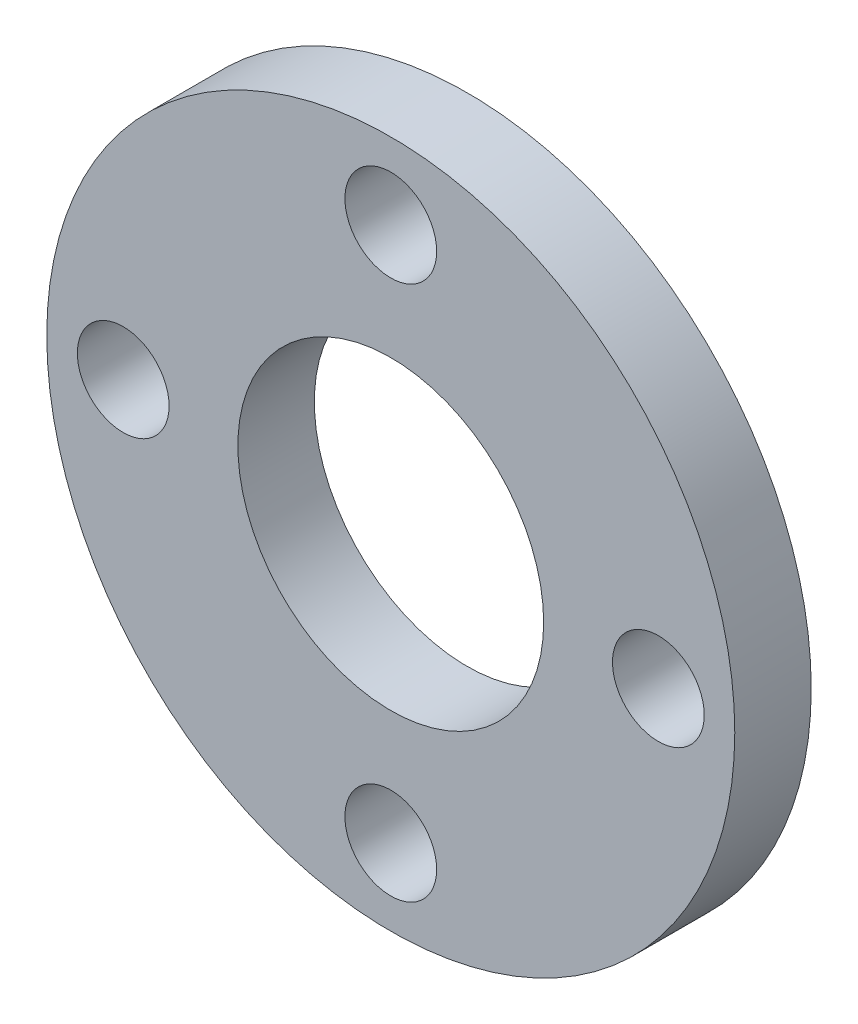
ISO-10303-21;
HEADER;
FILE_DESCRIPTION(('STEP AP214'),'2;1');
FILE_NAME('part.step','',(''),(''),'','','');
FILE_SCHEMA(('AUTOMOTIVE_DESIGN { 1 0 10303 214 1 1 1 1 }'));
ENDSEC;
DATA;
#1=APPLICATION_CONTEXT('core data for automotive mechanical design processes');
#2=APPLICATION_PROTOCOL_DEFINITION('international standard','automotive_design',2000,#1);
#3=PRODUCT_CONTEXT('',#1,'mechanical');
#4=PRODUCT('Part','Part','',(#3));
#5=PRODUCT_RELATED_PRODUCT_CATEGORY('part','',(#4));
#6=PRODUCT_DEFINITION_FORMATION('','',#4);
#7=PRODUCT_DEFINITION_CONTEXT('part definition',#1,'design');
#8=PRODUCT_DEFINITION('design','',#6,#7);
#9=PRODUCT_DEFINITION_SHAPE('','',#8);
#10=(LENGTH_UNIT() NAMED_UNIT(*) SI_UNIT(.MILLI.,.METRE.));
#11=(NAMED_UNIT(*) PLANE_ANGLE_UNIT() SI_UNIT($,.RADIAN.));
#12=(NAMED_UNIT(*) SI_UNIT($,.STERADIAN.) SOLID_ANGLE_UNIT());
#13=UNCERTAINTY_MEASURE_WITH_UNIT(LENGTH_MEASURE(1.E-05),#10,'distance_accuracy_value','');
#14=(GEOMETRIC_REPRESENTATION_CONTEXT(3) GLOBAL_UNCERTAINTY_ASSIGNED_CONTEXT((#13)) GLOBAL_UNIT_ASSIGNED_CONTEXT((#10,
#11,#12)) REPRESENTATION_CONTEXT('',''));
#15=CARTESIAN_POINT('',(0.,0.,0.));
#16=DIRECTION('',(0.,0.,1.));
#17=DIRECTION('',(1.,0.,0.));
#18=AXIS2_PLACEMENT_3D('',#15,#16,#17);
#19=CARTESIAN_POINT('',(0.,0.,5.));
#20=DIRECTION('',(0.,0.,1.));
#21=DIRECTION('',(1.,0.,0.));
#22=AXIS2_PLACEMENT_3D('',#19,#20,#21);
#23=PLANE('',#22);
#24=CARTESIAN_POINT('',(0.,-17.5,5.));
#25=DIRECTION('',(0.,0.,1.));
#26=DIRECTION('',(1.,0.,0.));
#27=AXIS2_PLACEMENT_3D('',#24,#25,#26);
#28=CIRCLE('',#27,3.);
#29=CARTESIAN_POINT('',(3.,-17.5,5.));
#30=VERTEX_POINT('',#29);
#31=EDGE_CURVE('E59',#30,#30,#28,.T.);
#32=ORIENTED_EDGE('',*,*,#31,.F.);
#33=EDGE_LOOP('',(#32));
#34=FACE_BOUND('',#33,.T.);
#35=CARTESIAN_POINT('',(0.,17.5066986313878,5.));
#36=DIRECTION('',(0.,0.,1.));
#37=DIRECTION('',(1.,0.,0.));
#38=AXIS2_PLACEMENT_3D('',#35,#36,#37);
#39=CIRCLE('',#38,3.);
#40=CARTESIAN_POINT('',(3.,17.5066986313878,5.));
#41=VERTEX_POINT('',#40);
#42=EDGE_CURVE('E47',#41,#41,#39,.T.);
#43=ORIENTED_EDGE('',*,*,#42,.F.);
#44=EDGE_LOOP('',(#43));
#45=FACE_BOUND('',#44,.T.);
#46=CARTESIAN_POINT('',(0.,0.,5.));
#47=DIRECTION('',(0.,0.,1.));
#48=DIRECTION('',(1.,0.,0.));
#49=AXIS2_PLACEMENT_3D('',#46,#47,#48);
#50=CIRCLE('',#49,22.5);
#51=CARTESIAN_POINT('',(22.5,0.,5.));
#52=VERTEX_POINT('',#51);
#53=EDGE_CURVE('E10',#52,#52,#50,.T.);
#54=ORIENTED_EDGE('',*,*,#53,.T.);
#55=EDGE_LOOP('',(#54));
#56=FACE_BOUND('',#55,.T.);
#57=CARTESIAN_POINT('',(0.,0.,5.));
#58=DIRECTION('',(0.,0.,1.));
#59=DIRECTION('',(1.,0.,0.));
#60=AXIS2_PLACEMENT_3D('',#57,#58,#59);
#61=CIRCLE('',#60,10.);
#62=CARTESIAN_POINT('',(10.,0.,5.));
#63=VERTEX_POINT('',#62);
#64=EDGE_CURVE('E42',#63,#63,#61,.T.);
#65=ORIENTED_EDGE('',*,*,#64,.F.);
#66=EDGE_LOOP('',(#65));
#67=FACE_BOUND('',#66,.T.);
#68=CARTESIAN_POINT('',(17.5,0.,5.));
#69=DIRECTION('',(0.,0.,1.));
#70=DIRECTION('',(1.,0.,0.));
#71=AXIS2_PLACEMENT_3D('',#68,#69,#70);
#72=CIRCLE('',#71,3.);
#73=CARTESIAN_POINT('',(20.5,0.,5.));
#74=VERTEX_POINT('',#73);
#75=EDGE_CURVE('E53',#74,#74,#72,.T.);
#76=ORIENTED_EDGE('',*,*,#75,.F.);
#77=EDGE_LOOP('',(#76));
#78=FACE_BOUND('',#77,.T.);
#79=CARTESIAN_POINT('',(-17.5,0.,5.));
#80=DIRECTION('',(0.,0.,1.));
#81=DIRECTION('',(1.,0.,0.));
#82=AXIS2_PLACEMENT_3D('',#79,#80,#81);
#83=CIRCLE('',#82,3.);
#84=CARTESIAN_POINT('',(-14.5,0.,5.));
#85=VERTEX_POINT('',#84);
#86=EDGE_CURVE('E65',#85,#85,#83,.T.);
#87=ORIENTED_EDGE('',*,*,#86,.F.);
#88=EDGE_LOOP('',(#87));
#89=FACE_BOUND('',#88,.T.);
#90=ADVANCED_FACE('F31',(#34,#45,#56,#67,#78,#89),#23,.T.);
#91=CARTESIAN_POINT('',(0.,0.,0.));
#92=DIRECTION('',(0.,0.,1.));
#93=DIRECTION('',(1.,0.,0.));
#94=AXIS2_PLACEMENT_3D('',#91,#92,#93);
#95=PLANE('',#94);
#96=CARTESIAN_POINT('',(0.,0.,0.));
#97=DIRECTION('',(0.,0.,1.));
#98=DIRECTION('',(1.,0.,0.));
#99=AXIS2_PLACEMENT_3D('',#96,#97,#98);
#100=CIRCLE('',#99,22.5);
#101=CARTESIAN_POINT('',(22.5,0.,0.));
#102=VERTEX_POINT('',#101);
#103=EDGE_CURVE('E35',#102,#102,#100,.T.);
#104=ORIENTED_EDGE('',*,*,#103,.F.);
#105=EDGE_LOOP('',(#104));
#106=FACE_BOUND('',#105,.T.);
#107=CARTESIAN_POINT('',(0.,0.,0.));
#108=DIRECTION('',(0.,0.,1.));
#109=DIRECTION('',(1.,0.,0.));
#110=AXIS2_PLACEMENT_3D('',#107,#108,#109);
#111=CIRCLE('',#110,10.);
#112=CARTESIAN_POINT('',(10.,0.,0.));
#113=VERTEX_POINT('',#112);
#114=EDGE_CURVE('E44',#113,#113,#111,.T.);
#115=ORIENTED_EDGE('',*,*,#114,.T.);
#116=EDGE_LOOP('',(#115));
#117=FACE_BOUND('',#116,.T.);
#118=CARTESIAN_POINT('',(0.,17.5066986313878,0.));
#119=DIRECTION('',(0.,0.,1.));
#120=DIRECTION('',(1.,0.,0.));
#121=AXIS2_PLACEMENT_3D('',#118,#119,#120);
#122=CIRCLE('',#121,3.);
#123=CARTESIAN_POINT('',(3.,17.5066986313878,0.));
#124=VERTEX_POINT('',#123);
#125=EDGE_CURVE('E50',#124,#124,#122,.T.);
#126=ORIENTED_EDGE('',*,*,#125,.T.);
#127=EDGE_LOOP('',(#126));
#128=FACE_BOUND('',#127,.T.);
#129=CARTESIAN_POINT('',(17.5,0.,0.));
#130=DIRECTION('',(0.,0.,1.));
#131=DIRECTION('',(1.,0.,0.));
#132=AXIS2_PLACEMENT_3D('',#129,#130,#131);
#133=CIRCLE('',#132,3.);
#134=CARTESIAN_POINT('',(20.5,0.,0.));
#135=VERTEX_POINT('',#134);
#136=EDGE_CURVE('E56',#135,#135,#133,.T.);
#137=ORIENTED_EDGE('',*,*,#136,.T.);
#138=EDGE_LOOP('',(#137));
#139=FACE_BOUND('',#138,.T.);
#140=CARTESIAN_POINT('',(0.,-17.5,0.));
#141=DIRECTION('',(0.,0.,1.));
#142=DIRECTION('',(1.,0.,0.));
#143=AXIS2_PLACEMENT_3D('',#140,#141,#142);
#144=CIRCLE('',#143,3.);
#145=CARTESIAN_POINT('',(3.,-17.5,0.));
#146=VERTEX_POINT('',#145);
#147=EDGE_CURVE('E62',#146,#146,#144,.T.);
#148=ORIENTED_EDGE('',*,*,#147,.T.);
#149=EDGE_LOOP('',(#148));
#150=FACE_BOUND('',#149,.T.);
#151=CARTESIAN_POINT('',(-17.5,0.,0.));
#152=DIRECTION('',(0.,0.,1.));
#153=DIRECTION('',(1.,0.,0.));
#154=AXIS2_PLACEMENT_3D('',#151,#152,#153);
#155=CIRCLE('',#154,3.);
#156=CARTESIAN_POINT('',(-14.5,0.,0.));
#157=VERTEX_POINT('',#156);
#158=EDGE_CURVE('E68',#157,#157,#155,.T.);
#159=ORIENTED_EDGE('',*,*,#158,.T.);
#160=EDGE_LOOP('',(#159));
#161=FACE_BOUND('',#160,.T.);
#162=ADVANCED_FACE('F78',(#106,#117,#128,#139,#150,#161),#95,.F.);
#163=CARTESIAN_POINT('',(0.,0.,5.));
#164=DIRECTION('',(0.,0.,-1.));
#165=DIRECTION('',(-1.,0.,0.));
#166=AXIS2_PLACEMENT_3D('',#163,#164,#165);
#167=CYLINDRICAL_SURFACE('',#166,22.5);
#168=ORIENTED_EDGE('',*,*,#53,.F.);
#169=EDGE_LOOP('',(#168));
#170=FACE_BOUND('',#169,.T.);
#171=ORIENTED_EDGE('',*,*,#103,.T.);
#172=EDGE_LOOP('',(#171));
#173=FACE_BOUND('',#172,.T.);
#174=ADVANCED_FACE('F33',(#170,#173),#167,.T.);
#175=CARTESIAN_POINT('',(0.,0.,5.));
#176=DIRECTION('',(0.,0.,-1.));
#177=DIRECTION('',(-1.,0.,0.));
#178=AXIS2_PLACEMENT_3D('',#175,#176,#177);
#179=CYLINDRICAL_SURFACE('',#178,10.);
#180=ORIENTED_EDGE('',*,*,#64,.T.);
#181=EDGE_LOOP('',(#180));
#182=FACE_BOUND('',#181,.T.);
#183=ORIENTED_EDGE('',*,*,#114,.F.);
#184=EDGE_LOOP('',(#183));
#185=FACE_BOUND('',#184,.T.);
#186=ADVANCED_FACE('F88',(#182,#185),#179,.F.);
#187=CARTESIAN_POINT('',(0.,17.5066986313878,5.));
#188=DIRECTION('',(0.,0.,-1.));
#189=DIRECTION('',(-1.,0.,0.));
#190=AXIS2_PLACEMENT_3D('',#187,#188,#189);
#191=CYLINDRICAL_SURFACE('',#190,3.);
#192=ORIENTED_EDGE('',*,*,#42,.T.);
#193=EDGE_LOOP('',(#192));
#194=FACE_BOUND('',#193,.T.);
#195=ORIENTED_EDGE('',*,*,#125,.F.);
#196=EDGE_LOOP('',(#195));
#197=FACE_BOUND('',#196,.T.);
#198=ADVANCED_FACE('F91',(#194,#197),#191,.F.);
#199=CARTESIAN_POINT('',(17.5,0.,5.));
#200=DIRECTION('',(0.,0.,-1.));
#201=DIRECTION('',(-1.,0.,0.));
#202=AXIS2_PLACEMENT_3D('',#199,#200,#201);
#203=CYLINDRICAL_SURFACE('',#202,3.);
#204=ORIENTED_EDGE('',*,*,#75,.T.);
#205=EDGE_LOOP('',(#204));
#206=FACE_BOUND('',#205,.T.);
#207=ORIENTED_EDGE('',*,*,#136,.F.);
#208=EDGE_LOOP('',(#207));
#209=FACE_BOUND('',#208,.T.);
#210=ADVANCED_FACE('F95',(#206,#209),#203,.F.);
#211=CARTESIAN_POINT('',(0.,-17.5,5.));
#212=DIRECTION('',(0.,0.,-1.));
#213=DIRECTION('',(-1.,0.,0.));
#214=AXIS2_PLACEMENT_3D('',#211,#212,#213);
#215=CYLINDRICAL_SURFACE('',#214,3.);
#216=ORIENTED_EDGE('',*,*,#31,.T.);
#217=EDGE_LOOP('',(#216));
#218=FACE_BOUND('',#217,.T.);
#219=ORIENTED_EDGE('',*,*,#147,.F.);
#220=EDGE_LOOP('',(#219));
#221=FACE_BOUND('',#220,.T.);
#222=ADVANCED_FACE('F99',(#218,#221),#215,.F.);
#223=CARTESIAN_POINT('',(-17.5,0.,5.));
#224=DIRECTION('',(0.,0.,-1.));
#225=DIRECTION('',(-1.,0.,0.));
#226=AXIS2_PLACEMENT_3D('',#223,#224,#225);
#227=CYLINDRICAL_SURFACE('',#226,3.);
#228=ORIENTED_EDGE('',*,*,#86,.T.);
#229=EDGE_LOOP('',(#228));
#230=FACE_BOUND('',#229,.T.);
#231=ORIENTED_EDGE('',*,*,#158,.F.);
#232=EDGE_LOOP('',(#231));
#233=FACE_BOUND('',#232,.T.);
#234=ADVANCED_FACE('F74',(#230,#233),#227,.F.);
#235=CLOSED_SHELL('',(#90,#162,#174,#186,#198,#210,#222,#234));
#236=MANIFOLD_SOLID_BREP('B2',#235);
#237=ADVANCED_BREP_SHAPE_REPRESENTATION('',(#18,#236),#14);
#238=SHAPE_DEFINITION_REPRESENTATION(#9,#237);
ENDSEC;
END-ISO-10303-21;
